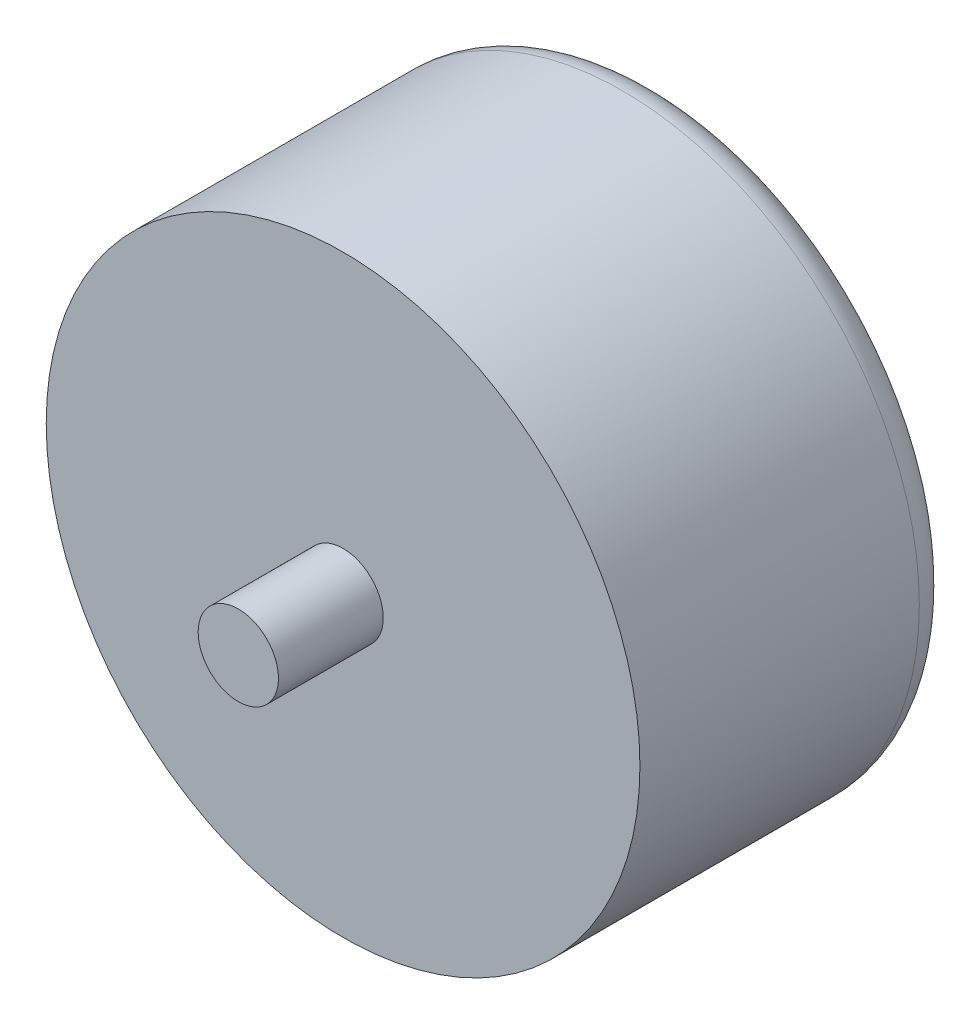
ISO-10303-21;
HEADER;
FILE_DESCRIPTION(('STEP AP214'),'2;1');
FILE_NAME('part.step','',(''),(''),'','','');
FILE_SCHEMA(('AUTOMOTIVE_DESIGN { 1 0 10303 214 1 1 1 1 }'));
ENDSEC;
DATA;
#1=APPLICATION_CONTEXT('core data for automotive mechanical design processes');
#2=APPLICATION_PROTOCOL_DEFINITION('international standard','automotive_design',2000,#1);
#3=PRODUCT_CONTEXT('',#1,'mechanical');
#4=PRODUCT('Part','Part','',(#3));
#5=PRODUCT_RELATED_PRODUCT_CATEGORY('part','',(#4));
#6=PRODUCT_DEFINITION_FORMATION('','',#4);
#7=PRODUCT_DEFINITION_CONTEXT('part definition',#1,'design');
#8=PRODUCT_DEFINITION('design','',#6,#7);
#9=PRODUCT_DEFINITION_SHAPE('','',#8);
#10=(LENGTH_UNIT() NAMED_UNIT(*) SI_UNIT(.MILLI.,.METRE.));
#11=(NAMED_UNIT(*) PLANE_ANGLE_UNIT() SI_UNIT($,.RADIAN.));
#12=(NAMED_UNIT(*) SI_UNIT($,.STERADIAN.) SOLID_ANGLE_UNIT());
#13=UNCERTAINTY_MEASURE_WITH_UNIT(LENGTH_MEASURE(1.E-05),#10,'distance_accuracy_value','');
#14=(GEOMETRIC_REPRESENTATION_CONTEXT(3) GLOBAL_UNCERTAINTY_ASSIGNED_CONTEXT((#13)) GLOBAL_UNIT_ASSIGNED_CONTEXT((#10,
#11,#12)) REPRESENTATION_CONTEXT('',''));
#15=CARTESIAN_POINT('',(0.,0.,0.));
#16=DIRECTION('',(0.,0.,1.));
#17=DIRECTION('',(1.,0.,0.));
#18=AXIS2_PLACEMENT_3D('',#15,#16,#17);
#19=CARTESIAN_POINT('',(186.,240.,-105.));
#20=DIRECTION('',(0.,0.,1.));
#21=DIRECTION('',(1.,0.,0.));
#22=AXIS2_PLACEMENT_3D('',#19,#20,#21);
#23=CYLINDRICAL_SURFACE('',#22,17.);
#24=CARTESIAN_POINT('',(186.,240.,-103.));
#25=DIRECTION('',(0.,0.,-1.));
#26=DIRECTION('',(-1.,0.,0.));
#27=AXIS2_PLACEMENT_3D('',#24,#25,#26);
#28=CIRCLE('',#27,17.);
#29=CARTESIAN_POINT('',(169.,240.,-103.));
#30=VERTEX_POINT('',#29);
#31=EDGE_CURVE('E10',#30,#30,#28,.F.);
#32=ORIENTED_EDGE('',*,*,#31,.T.);
#33=EDGE_LOOP('',(#32));
#34=FACE_BOUND('',#33,.T.);
#35=CARTESIAN_POINT('',(186.,240.,-87.));
#36=DIRECTION('',(0.,0.,-1.));
#37=DIRECTION('',(-1.,0.,0.));
#38=AXIS2_PLACEMENT_3D('',#35,#36,#37);
#39=CIRCLE('',#38,17.);
#40=CARTESIAN_POINT('',(169.,240.,-87.));
#41=VERTEX_POINT('',#40);
#42=EDGE_CURVE('E44',#41,#41,#39,.T.);
#43=ORIENTED_EDGE('',*,*,#42,.T.);
#44=EDGE_LOOP('',(#43));
#45=FACE_BOUND('',#44,.T.);
#46=ADVANCED_FACE('F33',(#34,#45),#23,.T.);
#47=CARTESIAN_POINT('',(186.,240.,-105.));
#48=DIRECTION('',(0.,0.,-1.));
#49=DIRECTION('',(-1.,0.,0.));
#50=AXIS2_PLACEMENT_3D('',#47,#48,#49);
#51=PLANE('',#50);
#52=CARTESIAN_POINT('',(186.,240.,-105.));
#53=DIRECTION('',(0.,0.,-1.));
#54=DIRECTION('',(-1.,0.,0.));
#55=AXIS2_PLACEMENT_3D('',#52,#53,#54);
#56=CIRCLE('',#55,15.);
#57=CARTESIAN_POINT('',(171.,240.,-105.));
#58=VERTEX_POINT('',#57);
#59=EDGE_CURVE('E40',#58,#58,#56,.T.);
#60=ORIENTED_EDGE('',*,*,#59,.T.);
#61=EDGE_LOOP('',(#60));
#62=FACE_BOUND('',#61,.T.);
#63=ADVANCED_FACE('F73',(#62),#51,.T.);
#64=CARTESIAN_POINT('',(186.,240.,-87.));
#65=DIRECTION('',(0.,0.,-1.));
#66=DIRECTION('',(-1.,0.,0.));
#67=AXIS2_PLACEMENT_3D('',#64,#65,#66);
#68=PLANE('',#67);
#69=CARTESIAN_POINT('',(186.,240.,-87.));
#70=DIRECTION('',(0.,0.,-1.));
#71=DIRECTION('',(-1.,0.,0.));
#72=AXIS2_PLACEMENT_3D('',#69,#70,#71);
#73=CIRCLE('',#72,2.30000000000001);
#74=CARTESIAN_POINT('',(183.7,240.,-87.));
#75=VERTEX_POINT('',#74);
#76=EDGE_CURVE('E48',#75,#75,#73,.T.);
#77=ORIENTED_EDGE('',*,*,#76,.T.);
#78=EDGE_LOOP('',(#77));
#79=FACE_BOUND('',#78,.T.);
#80=ORIENTED_EDGE('',*,*,#42,.F.);
#81=EDGE_LOOP('',(#80));
#82=FACE_BOUND('',#81,.T.);
#83=ADVANCED_FACE('F57',(#79,#82),#68,.F.);
#84=CARTESIAN_POINT('',(186.,240.,-103.));
#85=DIRECTION('',(0.,0.,-1.));
#86=DIRECTION('',(-1.,0.,0.));
#87=AXIS2_PLACEMENT_3D('',#84,#85,#86);
#88=TOROIDAL_SURFACE('',#87,15.,2.);
#89=ORIENTED_EDGE('',*,*,#31,.F.);
#90=EDGE_LOOP('',(#89));
#91=FACE_BOUND('',#90,.T.);
#92=ORIENTED_EDGE('',*,*,#59,.F.);
#93=EDGE_LOOP('',(#92));
#94=FACE_BOUND('',#93,.T.);
#95=ADVANCED_FACE('F35',(#91,#94),#88,.T.);
#96=CARTESIAN_POINT('',(186.,240.,-81.));
#97=DIRECTION('',(0.,0.,-1.));
#98=DIRECTION('',(-1.,0.,0.));
#99=AXIS2_PLACEMENT_3D('',#96,#97,#98);
#100=PLANE('',#99);
#101=CARTESIAN_POINT('',(186.,240.,-81.));
#102=DIRECTION('',(0.,0.,-1.));
#103=DIRECTION('',(-1.,0.,0.));
#104=AXIS2_PLACEMENT_3D('',#101,#102,#103);
#105=CIRCLE('',#104,2.30000000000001);
#106=CARTESIAN_POINT('',(183.7,240.,-81.));
#107=VERTEX_POINT('',#106);
#108=EDGE_CURVE('E51',#107,#107,#105,.F.);
#109=ORIENTED_EDGE('',*,*,#108,.T.);
#110=EDGE_LOOP('',(#109));
#111=FACE_BOUND('',#110,.T.);
#112=ADVANCED_FACE('F62',(#111),#100,.F.);
#113=CARTESIAN_POINT('',(186.,240.,-74.998));
#114=DIRECTION('',(0.,0.,-1.));
#115=DIRECTION('',(-1.,0.,0.));
#116=AXIS2_PLACEMENT_3D('',#113,#114,#115);
#117=CYLINDRICAL_SURFACE('',#116,2.30000000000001);
#118=ORIENTED_EDGE('',*,*,#108,.F.);
#119=EDGE_LOOP('',(#118));
#120=FACE_BOUND('',#119,.T.);
#121=ORIENTED_EDGE('',*,*,#76,.F.);
#122=EDGE_LOOP('',(#121));
#123=FACE_BOUND('',#122,.T.);
#124=ADVANCED_FACE('F60',(#120,#123),#117,.T.);
#125=CLOSED_SHELL('',(#46,#63,#83,#95,#112,#124));
#126=MANIFOLD_SOLID_BREP('B2',#125);
#127=ADVANCED_BREP_SHAPE_REPRESENTATION('',(#18,#126),#14);
#128=SHAPE_DEFINITION_REPRESENTATION(#9,#127);
ENDSEC;
END-ISO-10303-21;
